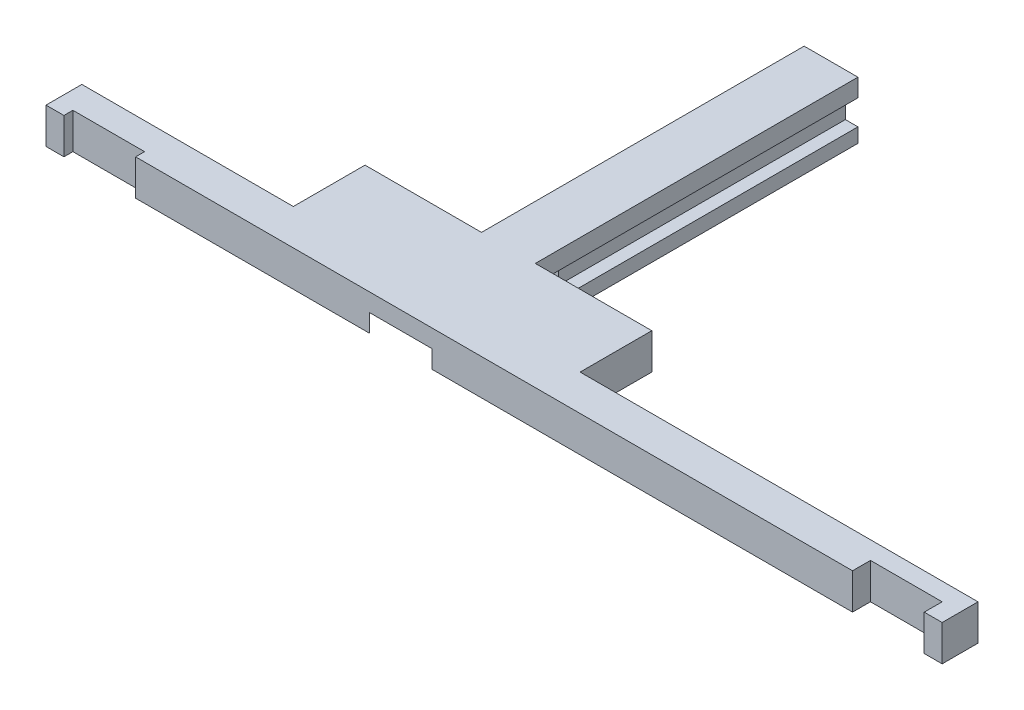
ISO-10303-21;
HEADER;
FILE_DESCRIPTION(('STEP AP214'),'2;1');
FILE_NAME('part.step','',(''),(''),'','','');
FILE_SCHEMA(('AUTOMOTIVE_DESIGN { 1 0 10303 214 1 1 1 1 }'));
ENDSEC;
DATA;
#1=APPLICATION_CONTEXT('core data for automotive mechanical design processes');
#2=APPLICATION_PROTOCOL_DEFINITION('international standard','automotive_design',2000,#1);
#3=PRODUCT_CONTEXT('',#1,'mechanical');
#4=PRODUCT('Part','Part','',(#3));
#5=PRODUCT_RELATED_PRODUCT_CATEGORY('part','',(#4));
#6=PRODUCT_DEFINITION_FORMATION('','',#4);
#7=PRODUCT_DEFINITION_CONTEXT('part definition',#1,'design');
#8=PRODUCT_DEFINITION('design','',#6,#7);
#9=PRODUCT_DEFINITION_SHAPE('','',#8);
#10=(LENGTH_UNIT() NAMED_UNIT(*) SI_UNIT(.MILLI.,.METRE.));
#11=(NAMED_UNIT(*) PLANE_ANGLE_UNIT() SI_UNIT($,.RADIAN.));
#12=(NAMED_UNIT(*) SI_UNIT($,.STERADIAN.) SOLID_ANGLE_UNIT());
#13=UNCERTAINTY_MEASURE_WITH_UNIT(LENGTH_MEASURE(1.E-05),#10,'distance_accuracy_value','');
#14=(GEOMETRIC_REPRESENTATION_CONTEXT(3) GLOBAL_UNCERTAINTY_ASSIGNED_CONTEXT((#13)) GLOBAL_UNIT_ASSIGNED_CONTEXT((#10,
#11,#12)) REPRESENTATION_CONTEXT('',''));
#15=CARTESIAN_POINT('',(0.,0.,0.));
#16=DIRECTION('',(0.,0.,1.));
#17=DIRECTION('',(1.,0.,0.));
#18=AXIS2_PLACEMENT_3D('',#15,#16,#17);
#19=CARTESIAN_POINT('',(-99.,10.,-30.));
#20=DIRECTION('',(0.,0.,1.));
#21=DIRECTION('',(1.,0.,0.));
#22=AXIS2_PLACEMENT_3D('',#19,#20,#21);
#23=PLANE('',#22);
#24=DIRECTION('',(0.,1.,0.));
#25=VECTOR('',#24,1.);
#26=CARTESIAN_POINT('',(-7.49999999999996,10.,-30.));
#27=LINE('',#26,#25);
#28=CARTESIAN_POINT('',(-7.49999999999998,5.,-30.));
#29=VERTEX_POINT('',#28);
#30=CARTESIAN_POINT('',(-7.49999999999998,10.,-30.));
#31=VERTEX_POINT('',#30);
#32=EDGE_CURVE('E327',#29,#31,#27,.T.);
#33=ORIENTED_EDGE('',*,*,#32,.F.);
#34=DIRECTION('',(-1.,0.,0.));
#35=VECTOR('',#34,1.);
#36=CARTESIAN_POINT('',(-99.,5.,-30.));
#37=LINE('',#36,#35);
#38=CARTESIAN_POINT('',(-16.,5.,-30.));
#39=VERTEX_POINT('',#38);
#40=EDGE_CURVE('E403',#29,#39,#37,.T.);
#41=ORIENTED_EDGE('',*,*,#40,.T.);
#42=DIRECTION('',(0.,-1.,0.));
#43=VECTOR('',#42,1.);
#44=CARTESIAN_POINT('',(-16.,5.,-30.));
#45=LINE('',#44,#43);
#46=CARTESIAN_POINT('',(-16.,0.,-30.));
#47=VERTEX_POINT('',#46);
#48=EDGE_CURVE('E400',#47,#39,#45,.F.);
#49=ORIENTED_EDGE('',*,*,#48,.F.);
#50=DIRECTION('',(-1.,0.,0.));
#51=VECTOR('',#50,1.);
#52=CARTESIAN_POINT('',(-99.,0.,-30.));
#53=LINE('',#52,#51);
#54=CARTESIAN_POINT('',(-40.,0.,-30.));
#55=VERTEX_POINT('',#54);
#56=EDGE_CURVE('E442',#47,#55,#53,.T.);
#57=ORIENTED_EDGE('',*,*,#56,.T.);
#58=DIRECTION('',(0.,1.,0.));
#59=VECTOR('',#58,1.);
#60=CARTESIAN_POINT('',(-40.,0.,-30.));
#61=LINE('',#60,#59);
#62=CARTESIAN_POINT('',(-40.,10.,-30.));
#63=VERTEX_POINT('',#62);
#64=EDGE_CURVE('E382',#55,#63,#61,.T.);
#65=ORIENTED_EDGE('',*,*,#64,.T.);
#66=DIRECTION('',(-1.,0.,0.));
#67=VECTOR('',#66,1.);
#68=CARTESIAN_POINT('',(-99.,10.,-30.));
#69=LINE('',#68,#67);
#70=EDGE_CURVE('E414',#31,#63,#69,.T.);
#71=ORIENTED_EDGE('',*,*,#70,.F.);
#72=EDGE_LOOP('',(#33,#41,#49,#57,#65,#71));
#73=FACE_BOUND('',#72,.T.);
#74=ADVANCED_FACE('F37',(#73),#23,.F.);
#75=DIRECTION('',(0.,-1.,0.));
#76=VECTOR('',#75,1.);
#77=CARTESIAN_POINT('',(7.5,10.,-30.));
#78=LINE('',#77,#76);
#79=CARTESIAN_POINT('',(7.50000000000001,10.,-30.));
#80=VERTEX_POINT('',#79);
#81=CARTESIAN_POINT('',(7.5,5.,-30.));
#82=VERTEX_POINT('',#81);
#83=EDGE_CURVE('E254',#80,#82,#78,.T.);
#84=ORIENTED_EDGE('',*,*,#83,.F.);
#85=CARTESIAN_POINT('',(40.,10.,-30.));
#86=VERTEX_POINT('',#85);
#87=EDGE_CURVE('E415',#86,#80,#69,.T.);
#88=ORIENTED_EDGE('',*,*,#87,.F.);
#89=DIRECTION('',(0.,1.,0.));
#90=VECTOR('',#89,1.);
#91=CARTESIAN_POINT('',(40.,0.,-30.));
#92=LINE('',#91,#90);
#93=CARTESIAN_POINT('',(40.,0.,-30.));
#94=VERTEX_POINT('',#93);
#95=EDGE_CURVE('E363',#94,#86,#92,.T.);
#96=ORIENTED_EDGE('',*,*,#95,.F.);
#97=CARTESIAN_POINT('',(16.,0.,-30.));
#98=VERTEX_POINT('',#97);
#99=EDGE_CURVE('E443',#94,#98,#53,.T.);
#100=ORIENTED_EDGE('',*,*,#99,.T.);
#101=DIRECTION('',(0.,-1.,0.));
#102=VECTOR('',#101,1.);
#103=CARTESIAN_POINT('',(16.,5.,-30.));
#104=LINE('',#103,#102);
#105=CARTESIAN_POINT('',(16.,5.,-30.));
#106=VERTEX_POINT('',#105);
#107=EDGE_CURVE('E397',#106,#98,#104,.T.);
#108=ORIENTED_EDGE('',*,*,#107,.F.);
#109=EDGE_CURVE('E404',#106,#82,#37,.T.);
#110=ORIENTED_EDGE('',*,*,#109,.T.);
#111=EDGE_LOOP('',(#84,#88,#96,#100,#108,#110));
#112=FACE_BOUND('',#111,.T.);
#113=ADVANCED_FACE('F583',(#112),#23,.F.);
#114=CARTESIAN_POINT('',(151.,10.,-30.));
#115=DIRECTION('',(-1.,0.,0.));
#116=DIRECTION('',(0.,0.,1.));
#117=AXIS2_PLACEMENT_3D('',#114,#115,#116);
#118=PLANE('',#117);
#119=DIRECTION('',(0.,1.,0.));
#120=VECTOR('',#119,1.);
#121=CARTESIAN_POINT('',(151.,0.,-9.99999999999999));
#122=LINE('',#121,#120);
#123=CARTESIAN_POINT('',(151.,0.,-10.));
#124=VERTEX_POINT('',#123);
#125=CARTESIAN_POINT('',(151.,10.,-9.99999999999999));
#126=VERTEX_POINT('',#125);
#127=EDGE_CURVE('E366',#124,#126,#122,.T.);
#128=ORIENTED_EDGE('',*,*,#127,.T.);
#129=DIRECTION('',(0.,0.,-1.));
#130=VECTOR('',#129,1.);
#131=CARTESIAN_POINT('',(151.,10.,-30.));
#132=LINE('',#131,#130);
#133=CARTESIAN_POINT('',(151.,10.,0.));
#134=VERTEX_POINT('',#133);
#135=EDGE_CURVE('E410',#134,#126,#132,.T.);
#136=ORIENTED_EDGE('',*,*,#135,.F.);
#137=DIRECTION('',(0.,-1.,0.));
#138=VECTOR('',#137,1.);
#139=CARTESIAN_POINT('',(151.,10.,0.));
#140=LINE('',#139,#138);
#141=CARTESIAN_POINT('',(151.,0.,0.));
#142=VERTEX_POINT('',#141);
#143=EDGE_CURVE('E490',#134,#142,#140,.T.);
#144=ORIENTED_EDGE('',*,*,#143,.T.);
#145=DIRECTION('',(0.,0.,-1.));
#146=VECTOR('',#145,1.);
#147=CARTESIAN_POINT('',(151.,0.,-30.));
#148=LINE('',#147,#146);
#149=EDGE_CURVE('E439',#142,#124,#148,.T.);
#150=ORIENTED_EDGE('',*,*,#149,.T.);
#151=EDGE_LOOP('',(#128,#136,#144,#150));
#152=FACE_BOUND('',#151,.T.);
#153=ADVANCED_FACE('F571',(#152),#118,.F.);
#154=CARTESIAN_POINT('',(0.,10.,0.));
#155=DIRECTION('',(0.,-1.,0.));
#156=DIRECTION('',(0.,0.,-1.));
#157=AXIS2_PLACEMENT_3D('',#154,#155,#156);
#158=PLANE('',#157);
#159=DIRECTION('',(0.,0.,-1.));
#160=VECTOR('',#159,1.);
#161=CARTESIAN_POINT('',(40.,10.,0.));
#162=LINE('',#161,#160);
#163=CARTESIAN_POINT('',(40.,10.,-9.99999999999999));
#164=VERTEX_POINT('',#163);
#165=EDGE_CURVE('E357',#164,#86,#162,.T.);
#166=ORIENTED_EDGE('',*,*,#165,.T.);
#167=ORIENTED_EDGE('',*,*,#87,.T.);
#168=DIRECTION('',(0.,0.,1.));
#169=VECTOR('',#168,1.);
#170=CARTESIAN_POINT('',(7.5,10.,-40.));
#171=LINE('',#170,#169);
#172=CARTESIAN_POINT('',(7.5,10.,-120.));
#173=VERTEX_POINT('',#172);
#174=EDGE_CURVE('E255',#173,#80,#171,.T.);
#175=ORIENTED_EDGE('',*,*,#174,.F.);
#176=DIRECTION('',(1.,0.,0.));
#177=VECTOR('',#176,1.);
#178=CARTESIAN_POINT('',(7.5,10.,-120.));
#179=LINE('',#178,#177);
#180=CARTESIAN_POINT('',(-7.49999999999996,10.,-120.));
#181=VERTEX_POINT('',#180);
#182=EDGE_CURVE('E270',#181,#173,#179,.T.);
#183=ORIENTED_EDGE('',*,*,#182,.F.);
#184=DIRECTION('',(0.,0.,1.));
#185=VECTOR('',#184,1.);
#186=CARTESIAN_POINT('',(-7.49999999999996,10.,-40.));
#187=LINE('',#186,#185);
#188=EDGE_CURVE('E335',#181,#31,#187,.T.);
#189=ORIENTED_EDGE('',*,*,#188,.T.);
#190=ORIENTED_EDGE('',*,*,#70,.T.);
#191=DIRECTION('',(0.,0.,-1.));
#192=VECTOR('',#191,1.);
#193=CARTESIAN_POINT('',(-40.,10.,0.));
#194=LINE('',#193,#192);
#195=CARTESIAN_POINT('',(-40.,10.,-10.));
#196=VERTEX_POINT('',#195);
#197=EDGE_CURVE('E374',#196,#63,#194,.T.);
#198=ORIENTED_EDGE('',*,*,#197,.F.);
#199=DIRECTION('',(1.,0.,0.));
#200=VECTOR('',#199,1.);
#201=CARTESIAN_POINT('',(0.,10.,-10.));
#202=LINE('',#201,#200);
#203=CARTESIAN_POINT('',(-99.,10.,-10.));
#204=VERTEX_POINT('',#203);
#205=EDGE_CURVE('E348',#204,#196,#202,.T.);
#206=ORIENTED_EDGE('',*,*,#205,.F.);
#207=DIRECTION('',(0.,0.,1.));
#208=VECTOR('',#207,1.);
#209=CARTESIAN_POINT('',(-99.,10.,-30.));
#210=LINE('',#209,#208);
#211=CARTESIAN_POINT('',(-99.,10.,0.));
#212=VERTEX_POINT('',#211);
#213=EDGE_CURVE('E418',#204,#212,#210,.T.);
#214=ORIENTED_EDGE('',*,*,#213,.T.);
#215=DIRECTION('',(1.,0.,0.));
#216=VECTOR('',#215,1.);
#217=CARTESIAN_POINT('',(-99.,10.,0.));
#218=LINE('',#217,#216);
#219=CARTESIAN_POINT('',(-94.,10.,0.));
#220=VERTEX_POINT('',#219);
#221=EDGE_CURVE('E420',#212,#220,#218,.T.);
#222=ORIENTED_EDGE('',*,*,#221,.T.);
#223=DIRECTION('',(0.,0.,-1.));
#224=VECTOR('',#223,1.);
#225=CARTESIAN_POINT('',(-94.,10.,-2.49999999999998));
#226=LINE('',#225,#224);
#227=CARTESIAN_POINT('',(-94.,10.,-2.49999999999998));
#228=VERTEX_POINT('',#227);
#229=EDGE_CURVE('E422',#220,#228,#226,.T.);
#230=ORIENTED_EDGE('',*,*,#229,.T.);
#231=DIRECTION('',(1.,0.,0.));
#232=VECTOR('',#231,1.);
#233=CARTESIAN_POINT('',(-74.,10.,-2.49999999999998));
#234=LINE('',#233,#232);
#235=CARTESIAN_POINT('',(-74.,10.,-2.49999999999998));
#236=VERTEX_POINT('',#235);
#237=EDGE_CURVE('E424',#228,#236,#234,.T.);
#238=ORIENTED_EDGE('',*,*,#237,.T.);
#239=DIRECTION('',(0.,0.,1.));
#240=VECTOR('',#239,1.);
#241=CARTESIAN_POINT('',(-74.,10.,-2.49999999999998));
#242=LINE('',#241,#240);
#243=CARTESIAN_POINT('',(-74.,10.,0.));
#244=VERTEX_POINT('',#243);
#245=EDGE_CURVE('E426',#236,#244,#242,.T.);
#246=ORIENTED_EDGE('',*,*,#245,.T.);
#247=DIRECTION('',(1.,0.,0.));
#248=VECTOR('',#247,1.);
#249=CARTESIAN_POINT('',(-74.,10.,0.));
#250=LINE('',#249,#248);
#251=CARTESIAN_POINT('',(126.,10.,0.));
#252=VERTEX_POINT('',#251);
#253=EDGE_CURVE('E428',#244,#252,#250,.T.);
#254=ORIENTED_EDGE('',*,*,#253,.T.);
#255=DIRECTION('',(0.,0.,-1.));
#256=VECTOR('',#255,1.);
#257=CARTESIAN_POINT('',(126.,10.,-5.));
#258=LINE('',#257,#256);
#259=CARTESIAN_POINT('',(126.,10.,-5.));
#260=VERTEX_POINT('',#259);
#261=EDGE_CURVE('E430',#252,#260,#258,.T.);
#262=ORIENTED_EDGE('',*,*,#261,.T.);
#263=DIRECTION('',(1.,0.,0.));
#264=VECTOR('',#263,1.);
#265=CARTESIAN_POINT('',(146.,10.,-5.));
#266=LINE('',#265,#264);
#267=CARTESIAN_POINT('',(146.,10.,-5.));
#268=VERTEX_POINT('',#267);
#269=EDGE_CURVE('E432',#260,#268,#266,.T.);
#270=ORIENTED_EDGE('',*,*,#269,.T.);
#271=DIRECTION('',(0.,0.,1.));
#272=VECTOR('',#271,1.);
#273=CARTESIAN_POINT('',(146.,10.,0.));
#274=LINE('',#273,#272);
#275=CARTESIAN_POINT('',(146.,10.,0.));
#276=VERTEX_POINT('',#275);
#277=EDGE_CURVE('E434',#268,#276,#274,.T.);
#278=ORIENTED_EDGE('',*,*,#277,.T.);
#279=DIRECTION('',(1.,0.,0.));
#280=VECTOR('',#279,1.);
#281=CARTESIAN_POINT('',(146.,10.,0.));
#282=LINE('',#281,#280);
#283=EDGE_CURVE('E407',#276,#134,#282,.T.);
#284=ORIENTED_EDGE('',*,*,#283,.T.);
#285=ORIENTED_EDGE('',*,*,#135,.T.);
#286=DIRECTION('',(-1.,0.,0.));
#287=VECTOR('',#286,1.);
#288=CARTESIAN_POINT('',(0.,10.,-9.99999999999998));
#289=LINE('',#288,#287);
#290=EDGE_CURVE('E354',#126,#164,#289,.T.);
#291=ORIENTED_EDGE('',*,*,#290,.T.);
#292=EDGE_LOOP('',(#166,#167,#175,#183,#189,#190,#198,#206,#214,#222,#230,#238,#246,#254,#262,
#270,#278,#284,#285,#291));
#293=FACE_BOUND('',#292,.T.);
#294=ADVANCED_FACE('F537',(#293),#158,.F.);
#295=CARTESIAN_POINT('',(0.,0.,0.));
#296=DIRECTION('',(0.,-1.,0.));
#297=DIRECTION('',(0.,0.,-1.));
#298=AXIS2_PLACEMENT_3D('',#295,#296,#297);
#299=PLANE('',#298);
#300=CARTESIAN_POINT('',(30.,0.,-18.));
#301=DIRECTION('',(0.,-1.,0.));
#302=DIRECTION('',(0.,0.,1.));
#303=AXIS2_PLACEMENT_3D('',#300,#301,#302);
#304=CIRCLE('',#303,2.);
#305=CARTESIAN_POINT('',(30.,0.,-16.));
#306=VERTEX_POINT('',#305);
#307=EDGE_CURVE('E338',#306,#306,#304,.T.);
#308=ORIENTED_EDGE('',*,*,#307,.F.);
#309=EDGE_LOOP('',(#308));
#310=FACE_BOUND('',#309,.T.);
#311=ORIENTED_EDGE('',*,*,#99,.F.);
#312=DIRECTION('',(0.,0.,-1.));
#313=VECTOR('',#312,1.);
#314=CARTESIAN_POINT('',(40.,0.,0.));
#315=LINE('',#314,#313);
#316=CARTESIAN_POINT('',(40.,0.,-9.99999999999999));
#317=VERTEX_POINT('',#316);
#318=EDGE_CURVE('E351',#317,#94,#315,.T.);
#319=ORIENTED_EDGE('',*,*,#318,.F.);
#320=DIRECTION('',(-1.,0.,0.));
#321=VECTOR('',#320,1.);
#322=CARTESIAN_POINT('',(0.,0.,-9.99999999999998));
#323=LINE('',#322,#321);
#324=EDGE_CURVE('E353',#124,#317,#323,.T.);
#325=ORIENTED_EDGE('',*,*,#324,.F.);
#326=ORIENTED_EDGE('',*,*,#149,.F.);
#327=DIRECTION('',(1.,0.,0.));
#328=VECTOR('',#327,1.);
#329=CARTESIAN_POINT('',(146.,0.,0.));
#330=LINE('',#329,#328);
#331=CARTESIAN_POINT('',(146.,0.,0.));
#332=VERTEX_POINT('',#331);
#333=EDGE_CURVE('E406',#332,#142,#330,.T.);
#334=ORIENTED_EDGE('',*,*,#333,.F.);
#335=DIRECTION('',(0.,0.,1.));
#336=VECTOR('',#335,1.);
#337=CARTESIAN_POINT('',(146.,0.,0.));
#338=LINE('',#337,#336);
#339=CARTESIAN_POINT('',(146.,0.,-5.));
#340=VERTEX_POINT('',#339);
#341=EDGE_CURVE('E411',#340,#332,#338,.T.);
#342=ORIENTED_EDGE('',*,*,#341,.F.);
#343=DIRECTION('',(1.,0.,0.));
#344=VECTOR('',#343,1.);
#345=CARTESIAN_POINT('',(146.,0.,-5.));
#346=LINE('',#345,#344);
#347=CARTESIAN_POINT('',(126.,0.,-5.));
#348=VERTEX_POINT('',#347);
#349=EDGE_CURVE('E461',#348,#340,#346,.T.);
#350=ORIENTED_EDGE('',*,*,#349,.F.);
#351=DIRECTION('',(0.,0.,-1.));
#352=VECTOR('',#351,1.);
#353=CARTESIAN_POINT('',(126.,0.,-5.));
#354=LINE('',#353,#352);
#355=CARTESIAN_POINT('',(126.,0.,0.));
#356=VERTEX_POINT('',#355);
#357=EDGE_CURVE('E459',#356,#348,#354,.T.);
#358=ORIENTED_EDGE('',*,*,#357,.F.);
#359=DIRECTION('',(1.,0.,0.));
#360=VECTOR('',#359,1.);
#361=CARTESIAN_POINT('',(-74.,0.,0.));
#362=LINE('',#361,#360);
#363=CARTESIAN_POINT('',(8.71779788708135,0.,0.));
#364=VERTEX_POINT('',#363);
#365=EDGE_CURVE('E455',#364,#356,#362,.T.);
#366=ORIENTED_EDGE('',*,*,#365,.F.);
#367=CARTESIAN_POINT('',(0.,0.,-18.));
#368=DIRECTION('',(0.,1.,0.));
#369=DIRECTION('',(0.,0.,1.));
#370=AXIS2_PLACEMENT_3D('',#367,#368,#369);
#371=CIRCLE('',#370,20.);
#372=EDGE_CURVE('E365',#364,#98,#371,.T.);
#373=ORIENTED_EDGE('',*,*,#372,.T.);
#374=EDGE_LOOP('',(#311,#319,#325,#326,#334,#342,#350,#358,#366,#373));
#375=FACE_BOUND('',#374,.T.);
#376=ADVANCED_FACE('F551',(#310,#375),#299,.T.);
#377=CARTESIAN_POINT('',(-74.,10.,0.));
#378=DIRECTION('',(0.,0.,-1.));
#379=DIRECTION('',(-1.,0.,0.));
#380=AXIS2_PLACEMENT_3D('',#377,#378,#379);
#381=PLANE('',#380);
#382=DIRECTION('',(0.,-1.,0.));
#383=VECTOR('',#382,1.);
#384=CARTESIAN_POINT('',(8.71779788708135,5.,0.));
#385=LINE('',#384,#383);
#386=CARTESIAN_POINT('',(8.71779788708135,5.,0.));
#387=VERTEX_POINT('',#386);
#388=EDGE_CURVE('E395',#364,#387,#385,.F.);
#389=ORIENTED_EDGE('',*,*,#388,.F.);
#390=ORIENTED_EDGE('',*,*,#365,.T.);
#391=DIRECTION('',(0.,-1.,0.));
#392=VECTOR('',#391,1.);
#393=CARTESIAN_POINT('',(126.,10.,0.));
#394=LINE('',#393,#392);
#395=EDGE_CURVE('E472',#252,#356,#394,.T.);
#396=ORIENTED_EDGE('',*,*,#395,.F.);
#397=ORIENTED_EDGE('',*,*,#253,.F.);
#398=DIRECTION('',(0.,-1.,0.));
#399=VECTOR('',#398,1.);
#400=CARTESIAN_POINT('',(-74.,10.,0.));
#401=LINE('',#400,#399);
#402=CARTESIAN_POINT('',(-74.,0.,0.));
#403=VERTEX_POINT('',#402);
#404=EDGE_CURVE('E475',#244,#403,#401,.T.);
#405=ORIENTED_EDGE('',*,*,#404,.T.);
#406=CARTESIAN_POINT('',(-8.71779788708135,0.,0.));
#407=VERTEX_POINT('',#406);
#408=EDGE_CURVE('E456',#403,#407,#362,.T.);
#409=ORIENTED_EDGE('',*,*,#408,.T.);
#410=DIRECTION('',(0.,-1.,0.));
#411=VECTOR('',#410,1.);
#412=CARTESIAN_POINT('',(-8.71779788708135,5.,0.));
#413=LINE('',#412,#411);
#414=CARTESIAN_POINT('',(-8.71779788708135,5.,0.));
#415=VERTEX_POINT('',#414);
#416=EDGE_CURVE('E390',#415,#407,#413,.T.);
#417=ORIENTED_EDGE('',*,*,#416,.F.);
#418=DIRECTION('',(1.,0.,0.));
#419=VECTOR('',#418,1.);
#420=CARTESIAN_POINT('',(-74.,5.,0.));
#421=LINE('',#420,#419);
#422=EDGE_CURVE('E11',#415,#387,#421,.T.);
#423=ORIENTED_EDGE('',*,*,#422,.T.);
#424=EDGE_LOOP('',(#389,#390,#396,#397,#405,#409,#417,#423));
#425=FACE_BOUND('',#424,.T.);
#426=ADVANCED_FACE('F504',(#425),#381,.F.);
#427=CARTESIAN_POINT('',(-30.,0.,-18.));
#428=DIRECTION('',(0.,-1.,0.));
#429=DIRECTION('',(0.,0.,-1.));
#430=AXIS2_PLACEMENT_3D('',#427,#428,#429);
#431=CIRCLE('',#430,2.);
#432=CARTESIAN_POINT('',(-30.,0.,-20.));
#433=VERTEX_POINT('',#432);
#434=EDGE_CURVE('E342',#433,#433,#431,.T.);
#435=ORIENTED_EDGE('',*,*,#434,.F.);
#436=EDGE_LOOP('',(#435));
#437=FACE_BOUND('',#436,.T.);
#438=DIRECTION('',(1.,0.,0.));
#439=VECTOR('',#438,1.);
#440=CARTESIAN_POINT('',(0.,0.,-10.));
#441=LINE('',#440,#439);
#442=CARTESIAN_POINT('',(-99.,0.,-10.));
#443=VERTEX_POINT('',#442);
#444=CARTESIAN_POINT('',(-40.,0.,-10.));
#445=VERTEX_POINT('',#444);
#446=EDGE_CURVE('E370',#443,#445,#441,.T.);
#447=ORIENTED_EDGE('',*,*,#446,.T.);
#448=DIRECTION('',(0.,0.,-1.));
#449=VECTOR('',#448,1.);
#450=CARTESIAN_POINT('',(-40.,0.,0.));
#451=LINE('',#450,#449);
#452=EDGE_CURVE('E373',#445,#55,#451,.T.);
#453=ORIENTED_EDGE('',*,*,#452,.T.);
#454=ORIENTED_EDGE('',*,*,#56,.F.);
#455=CARTESIAN_POINT('',(0.,0.,-18.));
#456=DIRECTION('',(0.,-1.,0.));
#457=DIRECTION('',(0.,0.,-1.));
#458=AXIS2_PLACEMENT_3D('',#455,#456,#457);
#459=CIRCLE('',#458,20.);
#460=EDGE_CURVE('E45',#47,#407,#459,.F.);
#461=ORIENTED_EDGE('',*,*,#460,.T.);
#462=ORIENTED_EDGE('',*,*,#408,.F.);
#463=DIRECTION('',(0.,0.,1.));
#464=VECTOR('',#463,1.);
#465=CARTESIAN_POINT('',(-74.,0.,-2.49999999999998));
#466=LINE('',#465,#464);
#467=CARTESIAN_POINT('',(-74.,0.,-2.49999999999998));
#468=VERTEX_POINT('',#467);
#469=EDGE_CURVE('E453',#468,#403,#466,.T.);
#470=ORIENTED_EDGE('',*,*,#469,.F.);
#471=DIRECTION('',(1.,0.,0.));
#472=VECTOR('',#471,1.);
#473=CARTESIAN_POINT('',(-74.,0.,-2.49999999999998));
#474=LINE('',#473,#472);
#475=CARTESIAN_POINT('',(-94.,0.,-2.49999999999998));
#476=VERTEX_POINT('',#475);
#477=EDGE_CURVE('E451',#476,#468,#474,.T.);
#478=ORIENTED_EDGE('',*,*,#477,.F.);
#479=DIRECTION('',(0.,0.,-1.));
#480=VECTOR('',#479,1.);
#481=CARTESIAN_POINT('',(-94.,0.,-2.49999999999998));
#482=LINE('',#481,#480);
#483=CARTESIAN_POINT('',(-94.,0.,0.));
#484=VERTEX_POINT('',#483);
#485=EDGE_CURVE('E449',#484,#476,#482,.T.);
#486=ORIENTED_EDGE('',*,*,#485,.F.);
#487=DIRECTION('',(1.,0.,0.));
#488=VECTOR('',#487,1.);
#489=CARTESIAN_POINT('',(-99.,0.,0.));
#490=LINE('',#489,#488);
#491=CARTESIAN_POINT('',(-99.,0.,0.));
#492=VERTEX_POINT('',#491);
#493=EDGE_CURVE('E447',#492,#484,#490,.T.);
#494=ORIENTED_EDGE('',*,*,#493,.F.);
#495=DIRECTION('',(0.,0.,1.));
#496=VECTOR('',#495,1.);
#497=CARTESIAN_POINT('',(-99.,0.,-30.));
#498=LINE('',#497,#496);
#499=EDGE_CURVE('E445',#443,#492,#498,.T.);
#500=ORIENTED_EDGE('',*,*,#499,.F.);
#501=EDGE_LOOP('',(#447,#453,#454,#461,#462,#470,#478,#486,#494,#500));
#502=FACE_BOUND('',#501,.T.);
#503=ADVANCED_FACE('F496',(#437,#502),#299,.T.);
#504=CARTESIAN_POINT('',(146.,10.,0.));
#505=DIRECTION('',(0.,0.,-1.));
#506=DIRECTION('',(-1.,0.,0.));
#507=AXIS2_PLACEMENT_3D('',#504,#505,#506);
#508=PLANE('',#507);
#509=ORIENTED_EDGE('',*,*,#333,.T.);
#510=ORIENTED_EDGE('',*,*,#143,.F.);
#511=ORIENTED_EDGE('',*,*,#283,.F.);
#512=DIRECTION('',(0.,-1.,0.));
#513=VECTOR('',#512,1.);
#514=CARTESIAN_POINT('',(146.,10.,0.));
#515=LINE('',#514,#513);
#516=EDGE_CURVE('E436',#276,#332,#515,.T.);
#517=ORIENTED_EDGE('',*,*,#516,.T.);
#518=EDGE_LOOP('',(#509,#510,#511,#517));
#519=FACE_BOUND('',#518,.T.);
#520=ADVANCED_FACE('F39',(#519),#508,.F.);
#521=CARTESIAN_POINT('',(-99.,10.,-30.));
#522=DIRECTION('',(1.,0.,0.));
#523=DIRECTION('',(0.,0.,-1.));
#524=AXIS2_PLACEMENT_3D('',#521,#522,#523);
#525=PLANE('',#524);
#526=ORIENTED_EDGE('',*,*,#213,.F.);
#527=DIRECTION('',(0.,1.,0.));
#528=VECTOR('',#527,1.);
#529=CARTESIAN_POINT('',(-99.,0.,-10.));
#530=LINE('',#529,#528);
#531=EDGE_CURVE('E360',#443,#204,#530,.T.);
#532=ORIENTED_EDGE('',*,*,#531,.F.);
#533=ORIENTED_EDGE('',*,*,#499,.T.);
#534=DIRECTION('',(0.,-1.,0.));
#535=VECTOR('',#534,1.);
#536=CARTESIAN_POINT('',(-99.,10.,0.));
#537=LINE('',#536,#535);
#538=EDGE_CURVE('E487',#212,#492,#537,.T.);
#539=ORIENTED_EDGE('',*,*,#538,.F.);
#540=EDGE_LOOP('',(#526,#532,#533,#539));
#541=FACE_BOUND('',#540,.T.);
#542=ADVANCED_FACE('F531',(#541),#525,.F.);
#543=CARTESIAN_POINT('',(-99.,10.,0.));
#544=DIRECTION('',(0.,0.,-1.));
#545=DIRECTION('',(-1.,0.,0.));
#546=AXIS2_PLACEMENT_3D('',#543,#544,#545);
#547=PLANE('',#546);
#548=ORIENTED_EDGE('',*,*,#493,.T.);
#549=DIRECTION('',(0.,-1.,0.));
#550=VECTOR('',#549,1.);
#551=CARTESIAN_POINT('',(-94.,10.,0.));
#552=LINE('',#551,#550);
#553=EDGE_CURVE('E484',#220,#484,#552,.T.);
#554=ORIENTED_EDGE('',*,*,#553,.F.);
#555=ORIENTED_EDGE('',*,*,#221,.F.);
#556=ORIENTED_EDGE('',*,*,#538,.T.);
#557=EDGE_LOOP('',(#548,#554,#555,#556));
#558=FACE_BOUND('',#557,.T.);
#559=ADVANCED_FACE('F525',(#558),#547,.F.);
#560=CARTESIAN_POINT('',(-94.,10.,-2.49999999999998));
#561=DIRECTION('',(-1.,0.,0.));
#562=DIRECTION('',(0.,0.,1.));
#563=AXIS2_PLACEMENT_3D('',#560,#561,#562);
#564=PLANE('',#563);
#565=ORIENTED_EDGE('',*,*,#485,.T.);
#566=DIRECTION('',(0.,-1.,0.));
#567=VECTOR('',#566,1.);
#568=CARTESIAN_POINT('',(-94.,10.,-2.49999999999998));
#569=LINE('',#568,#567);
#570=EDGE_CURVE('E481',#228,#476,#569,.T.);
#571=ORIENTED_EDGE('',*,*,#570,.F.);
#572=ORIENTED_EDGE('',*,*,#229,.F.);
#573=ORIENTED_EDGE('',*,*,#553,.T.);
#574=EDGE_LOOP('',(#565,#571,#572,#573));
#575=FACE_BOUND('',#574,.T.);
#576=ADVANCED_FACE('F521',(#575),#564,.F.);
#577=CARTESIAN_POINT('',(-74.,10.,-2.49999999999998));
#578=DIRECTION('',(0.,0.,-1.));
#579=DIRECTION('',(-1.,0.,0.));
#580=AXIS2_PLACEMENT_3D('',#577,#578,#579);
#581=PLANE('',#580);
#582=ORIENTED_EDGE('',*,*,#477,.T.);
#583=DIRECTION('',(0.,-1.,0.));
#584=VECTOR('',#583,1.);
#585=CARTESIAN_POINT('',(-74.,10.,-2.49999999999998));
#586=LINE('',#585,#584);
#587=EDGE_CURVE('E478',#236,#468,#586,.T.);
#588=ORIENTED_EDGE('',*,*,#587,.F.);
#589=ORIENTED_EDGE('',*,*,#237,.F.);
#590=ORIENTED_EDGE('',*,*,#570,.T.);
#591=EDGE_LOOP('',(#582,#588,#589,#590));
#592=FACE_BOUND('',#591,.T.);
#593=ADVANCED_FACE('F516',(#592),#581,.F.);
#594=CARTESIAN_POINT('',(-74.,10.,-2.49999999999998));
#595=DIRECTION('',(1.,0.,0.));
#596=DIRECTION('',(0.,0.,-1.));
#597=AXIS2_PLACEMENT_3D('',#594,#595,#596);
#598=PLANE('',#597);
#599=ORIENTED_EDGE('',*,*,#469,.T.);
#600=ORIENTED_EDGE('',*,*,#404,.F.);
#601=ORIENTED_EDGE('',*,*,#245,.F.);
#602=ORIENTED_EDGE('',*,*,#587,.T.);
#603=EDGE_LOOP('',(#599,#600,#601,#602));
#604=FACE_BOUND('',#603,.T.);
#605=ADVANCED_FACE('F510',(#604),#598,.F.);
#606=CARTESIAN_POINT('',(126.,10.,-5.));
#607=DIRECTION('',(-1.,0.,0.));
#608=DIRECTION('',(0.,0.,1.));
#609=AXIS2_PLACEMENT_3D('',#606,#607,#608);
#610=PLANE('',#609);
#611=ORIENTED_EDGE('',*,*,#357,.T.);
#612=DIRECTION('',(0.,-1.,0.));
#613=VECTOR('',#612,1.);
#614=CARTESIAN_POINT('',(126.,10.,-5.));
#615=LINE('',#614,#613);
#616=EDGE_CURVE('E469',#260,#348,#615,.T.);
#617=ORIENTED_EDGE('',*,*,#616,.F.);
#618=ORIENTED_EDGE('',*,*,#261,.F.);
#619=ORIENTED_EDGE('',*,*,#395,.T.);
#620=EDGE_LOOP('',(#611,#617,#618,#619));
#621=FACE_BOUND('',#620,.T.);
#622=ADVANCED_FACE('F556',(#621),#610,.F.);
#623=CARTESIAN_POINT('',(146.,10.,-5.));
#624=DIRECTION('',(0.,0.,-1.));
#625=DIRECTION('',(-1.,0.,0.));
#626=AXIS2_PLACEMENT_3D('',#623,#624,#625);
#627=PLANE('',#626);
#628=ORIENTED_EDGE('',*,*,#349,.T.);
#629=DIRECTION('',(0.,-1.,0.));
#630=VECTOR('',#629,1.);
#631=CARTESIAN_POINT('',(146.,10.,-5.));
#632=LINE('',#631,#630);
#633=EDGE_CURVE('E466',#268,#340,#632,.T.);
#634=ORIENTED_EDGE('',*,*,#633,.F.);
#635=ORIENTED_EDGE('',*,*,#269,.F.);
#636=ORIENTED_EDGE('',*,*,#616,.T.);
#637=EDGE_LOOP('',(#628,#634,#635,#636));
#638=FACE_BOUND('',#637,.T.);
#639=ADVANCED_FACE('F560',(#638),#627,.F.);
#640=CARTESIAN_POINT('',(146.,10.,0.));
#641=DIRECTION('',(1.,0.,0.));
#642=DIRECTION('',(0.,0.,-1.));
#643=AXIS2_PLACEMENT_3D('',#640,#641,#642);
#644=PLANE('',#643);
#645=ORIENTED_EDGE('',*,*,#341,.T.);
#646=ORIENTED_EDGE('',*,*,#516,.F.);
#647=ORIENTED_EDGE('',*,*,#277,.F.);
#648=ORIENTED_EDGE('',*,*,#633,.T.);
#649=EDGE_LOOP('',(#645,#646,#647,#648));
#650=FACE_BOUND('',#649,.T.);
#651=ADVANCED_FACE('F567',(#650),#644,.F.);
#652=CARTESIAN_POINT('',(0.,5.,-18.));
#653=DIRECTION('',(0.,1.,0.));
#654=DIRECTION('',(0.,0.,1.));
#655=AXIS2_PLACEMENT_3D('',#652,#653,#654);
#656=PLANE('',#655);
#657=CARTESIAN_POINT('',(0.,5.,-18.));
#658=DIRECTION('',(0.,1.,0.));
#659=DIRECTION('',(0.,0.,1.));
#660=AXIS2_PLACEMENT_3D('',#657,#658,#659);
#661=CIRCLE('',#660,20.);
#662=EDGE_CURVE('E387',#387,#106,#661,.T.);
#663=ORIENTED_EDGE('',*,*,#662,.F.);
#664=ORIENTED_EDGE('',*,*,#422,.F.);
#665=EDGE_CURVE('E391',#39,#415,#661,.T.);
#666=ORIENTED_EDGE('',*,*,#665,.F.);
#667=ORIENTED_EDGE('',*,*,#40,.F.);
#668=DIRECTION('',(0.,0.,1.));
#669=VECTOR('',#668,1.);
#670=CARTESIAN_POINT('',(-7.49999999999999,5.00000000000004,-40.));
#671=LINE('',#670,#669);
#672=CARTESIAN_POINT('',(-7.49999999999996,5.,-120.));
#673=VERTEX_POINT('',#672);
#674=EDGE_CURVE('E256',#673,#29,#671,.T.);
#675=ORIENTED_EDGE('',*,*,#674,.F.);
#676=DIRECTION('',(-1.,0.,0.));
#677=VECTOR('',#676,1.);
#678=CARTESIAN_POINT('',(-7.49999999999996,5.,-120.));
#679=LINE('',#678,#677);
#680=CARTESIAN_POINT('',(-3.99999999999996,5.,-120.));
#681=VERTEX_POINT('',#680);
#682=EDGE_CURVE('E289',#681,#673,#679,.T.);
#683=ORIENTED_EDGE('',*,*,#682,.F.);
#684=DIRECTION('',(0.,0.,1.));
#685=VECTOR('',#684,1.);
#686=CARTESIAN_POINT('',(-3.99999999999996,5.,-120.));
#687=LINE('',#686,#685);
#688=CARTESIAN_POINT('',(-3.99999999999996,5.00000000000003,-40.));
#689=VERTEX_POINT('',#688);
#690=EDGE_CURVE('E295',#681,#689,#687,.T.);
#691=ORIENTED_EDGE('',*,*,#690,.T.);
#692=DIRECTION('',(-1.,0.,0.));
#693=VECTOR('',#692,1.);
#694=CARTESIAN_POINT('',(7.5,5.,-40.));
#695=LINE('',#694,#693);
#696=CARTESIAN_POINT('',(4.,5.00000000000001,-40.));
#697=VERTEX_POINT('',#696);
#698=EDGE_CURVE('E52',#697,#689,#695,.T.);
#699=ORIENTED_EDGE('',*,*,#698,.F.);
#700=DIRECTION('',(0.,0.,1.));
#701=VECTOR('',#700,1.);
#702=CARTESIAN_POINT('',(4.,5.,-120.));
#703=LINE('',#702,#701);
#704=CARTESIAN_POINT('',(4.,5.,-120.));
#705=VERTEX_POINT('',#704);
#706=EDGE_CURVE('E261',#705,#697,#703,.T.);
#707=ORIENTED_EDGE('',*,*,#706,.F.);
#708=DIRECTION('',(-1.,0.,0.));
#709=VECTOR('',#708,1.);
#710=CARTESIAN_POINT('',(7.5,5.,-120.));
#711=LINE('',#710,#709);
#712=CARTESIAN_POINT('',(7.5,5.,-120.));
#713=VERTEX_POINT('',#712);
#714=EDGE_CURVE('E258',#713,#705,#711,.T.);
#715=ORIENTED_EDGE('',*,*,#714,.F.);
#716=DIRECTION('',(0.,0.,1.));
#717=VECTOR('',#716,1.);
#718=CARTESIAN_POINT('',(7.5,5.,-40.));
#719=LINE('',#718,#717);
#720=EDGE_CURVE('E248',#713,#82,#719,.T.);
#721=ORIENTED_EDGE('',*,*,#720,.T.);
#722=ORIENTED_EDGE('',*,*,#109,.F.);
#723=EDGE_LOOP('',(#663,#664,#666,#667,#675,#683,#691,#699,#707,#715,#721,#722));
#724=FACE_BOUND('',#723,.T.);
#725=ADVANCED_FACE('F260',(#724),#656,.F.);
#726=CARTESIAN_POINT('',(0.,5.,-18.));
#727=DIRECTION('',(0.,-1.,0.));
#728=DIRECTION('',(0.,0.,-1.));
#729=AXIS2_PLACEMENT_3D('',#726,#727,#728);
#730=CYLINDRICAL_SURFACE('',#729,20.);
#731=ORIENTED_EDGE('',*,*,#48,.T.);
#732=ORIENTED_EDGE('',*,*,#665,.T.);
#733=ORIENTED_EDGE('',*,*,#416,.T.);
#734=ORIENTED_EDGE('',*,*,#460,.F.);
#735=EDGE_LOOP('',(#731,#732,#733,#734));
#736=FACE_BOUND('',#735,.T.);
#737=ADVANCED_FACE('F545',(#736),#730,.F.);
#738=ORIENTED_EDGE('',*,*,#107,.T.);
#739=ORIENTED_EDGE('',*,*,#372,.F.);
#740=ORIENTED_EDGE('',*,*,#388,.T.);
#741=ORIENTED_EDGE('',*,*,#662,.T.);
#742=EDGE_LOOP('',(#738,#739,#740,#741));
#743=FACE_BOUND('',#742,.T.);
#744=ADVANCED_FACE('F702',(#743),#730,.F.);
#745=CARTESIAN_POINT('',(40.,0.,0.));
#746=DIRECTION('',(1.,0.,0.));
#747=DIRECTION('',(0.,0.,-1.));
#748=AXIS2_PLACEMENT_3D('',#745,#746,#747);
#749=PLANE('',#748);
#750=ORIENTED_EDGE('',*,*,#165,.F.);
#751=DIRECTION('',(0.,1.,0.));
#752=VECTOR('',#751,1.);
#753=CARTESIAN_POINT('',(40.,0.,-9.99999999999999));
#754=LINE('',#753,#752);
#755=EDGE_CURVE('E356',#317,#164,#754,.T.);
#756=ORIENTED_EDGE('',*,*,#755,.F.);
#757=ORIENTED_EDGE('',*,*,#318,.T.);
#758=ORIENTED_EDGE('',*,*,#95,.T.);
#759=EDGE_LOOP('',(#750,#756,#757,#758));
#760=FACE_BOUND('',#759,.T.);
#761=ADVANCED_FACE('F580',(#760),#749,.T.);
#762=CARTESIAN_POINT('',(0.,0.,-9.99999999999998));
#763=DIRECTION('',(0.,0.,-1.));
#764=DIRECTION('',(-1.,0.,0.));
#765=AXIS2_PLACEMENT_3D('',#762,#763,#764);
#766=PLANE('',#765);
#767=ORIENTED_EDGE('',*,*,#290,.F.);
#768=ORIENTED_EDGE('',*,*,#127,.F.);
#769=ORIENTED_EDGE('',*,*,#324,.T.);
#770=ORIENTED_EDGE('',*,*,#755,.T.);
#771=EDGE_LOOP('',(#767,#768,#769,#770));
#772=FACE_BOUND('',#771,.T.);
#773=ADVANCED_FACE('F575',(#772),#766,.T.);
#774=CARTESIAN_POINT('',(0.,0.,-10.));
#775=DIRECTION('',(0.,0.,1.));
#776=DIRECTION('',(1.,0.,0.));
#777=AXIS2_PLACEMENT_3D('',#774,#775,#776);
#778=PLANE('',#777);
#779=ORIENTED_EDGE('',*,*,#205,.T.);
#780=DIRECTION('',(0.,1.,0.));
#781=VECTOR('',#780,1.);
#782=CARTESIAN_POINT('',(-40.,0.,-10.));
#783=LINE('',#782,#781);
#784=EDGE_CURVE('E377',#445,#196,#783,.T.);
#785=ORIENTED_EDGE('',*,*,#784,.F.);
#786=ORIENTED_EDGE('',*,*,#446,.F.);
#787=ORIENTED_EDGE('',*,*,#531,.T.);
#788=EDGE_LOOP('',(#779,#785,#786,#787));
#789=FACE_BOUND('',#788,.T.);
#790=ADVANCED_FACE('F534',(#789),#778,.F.);
#791=CARTESIAN_POINT('',(-40.,0.,0.));
#792=DIRECTION('',(1.,0.,0.));
#793=DIRECTION('',(0.,0.,-1.));
#794=AXIS2_PLACEMENT_3D('',#791,#792,#793);
#795=PLANE('',#794);
#796=ORIENTED_EDGE('',*,*,#197,.T.);
#797=ORIENTED_EDGE('',*,*,#64,.F.);
#798=ORIENTED_EDGE('',*,*,#452,.F.);
#799=ORIENTED_EDGE('',*,*,#784,.T.);
#800=EDGE_LOOP('',(#796,#797,#798,#799));
#801=FACE_BOUND('',#800,.T.);
#802=ADVANCED_FACE('F539',(#801),#795,.F.);
#803=CARTESIAN_POINT('',(-30.,-10.,-18.));
#804=DIRECTION('',(0.,1.,0.));
#805=DIRECTION('',(0.,0.,1.));
#806=AXIS2_PLACEMENT_3D('',#803,#804,#805);
#807=CYLINDRICAL_SURFACE('',#806,2.);
#808=CARTESIAN_POINT('',(-30.,-10.,-18.));
#809=DIRECTION('',(0.,-1.,0.));
#810=DIRECTION('',(0.,0.,-1.));
#811=AXIS2_PLACEMENT_3D('',#808,#809,#810);
#812=CIRCLE('',#811,2.);
#813=CARTESIAN_POINT('',(-30.,-10.,-20.));
#814=VERTEX_POINT('',#813);
#815=EDGE_CURVE('E345',#814,#814,#812,.T.);
#816=ORIENTED_EDGE('',*,*,#815,.F.);
#817=EDGE_LOOP('',(#816));
#818=FACE_BOUND('',#817,.T.);
#819=ORIENTED_EDGE('',*,*,#434,.T.);
#820=EDGE_LOOP('',(#819));
#821=FACE_BOUND('',#820,.T.);
#822=ADVANCED_FACE('F684',(#818,#821),#807,.T.);
#823=CARTESIAN_POINT('',(-30.,-10.,-18.));
#824=DIRECTION('',(0.,-1.,0.));
#825=DIRECTION('',(0.,0.,-1.));
#826=AXIS2_PLACEMENT_3D('',#823,#824,#825);
#827=PLANE('',#826);
#828=ORIENTED_EDGE('',*,*,#815,.T.);
#829=EDGE_LOOP('',(#828));
#830=FACE_BOUND('',#829,.T.);
#831=ADVANCED_FACE('F686',(#830),#827,.T.);
#832=CARTESIAN_POINT('',(30.,-10.,-18.));
#833=DIRECTION('',(0.,1.,0.));
#834=DIRECTION('',(0.,0.,1.));
#835=AXIS2_PLACEMENT_3D('',#832,#833,#834);
#836=CYLINDRICAL_SURFACE('',#835,2.);
#837=CARTESIAN_POINT('',(30.,-10.,-18.));
#838=DIRECTION('',(0.,-1.,0.));
#839=DIRECTION('',(0.,0.,1.));
#840=AXIS2_PLACEMENT_3D('',#837,#838,#839);
#841=CIRCLE('',#840,2.);
#842=CARTESIAN_POINT('',(30.,-10.,-16.));
#843=VERTEX_POINT('',#842);
#844=EDGE_CURVE('E339',#843,#843,#841,.T.);
#845=ORIENTED_EDGE('',*,*,#844,.F.);
#846=EDGE_LOOP('',(#845));
#847=FACE_BOUND('',#846,.T.);
#848=ORIENTED_EDGE('',*,*,#307,.T.);
#849=EDGE_LOOP('',(#848));
#850=FACE_BOUND('',#849,.T.);
#851=ADVANCED_FACE('F692',(#847,#850),#836,.T.);
#852=CARTESIAN_POINT('',(30.,-10.,-18.));
#853=DIRECTION('',(0.,1.,0.));
#854=DIRECTION('',(0.,0.,1.));
#855=AXIS2_PLACEMENT_3D('',#852,#853,#854);
#856=PLANE('',#855);
#857=ORIENTED_EDGE('',*,*,#844,.T.);
#858=EDGE_LOOP('',(#857));
#859=FACE_BOUND('',#858,.T.);
#860=ADVANCED_FACE('F781',(#859),#856,.F.);
#861=CARTESIAN_POINT('',(-7.49999999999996,10.,-40.));
#862=DIRECTION('',(1.,0.,0.));
#863=DIRECTION('',(0.,1.,0.));
#864=AXIS2_PLACEMENT_3D('',#861,#862,#863);
#865=PLANE('',#864);
#866=ORIENTED_EDGE('',*,*,#32,.T.);
#867=ORIENTED_EDGE('',*,*,#188,.F.);
#868=DIRECTION('',(0.,1.,0.));
#869=VECTOR('',#868,1.);
#870=CARTESIAN_POINT('',(-7.49999999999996,10.,-120.));
#871=LINE('',#870,#869);
#872=EDGE_CURVE('E292',#673,#181,#871,.T.);
#873=ORIENTED_EDGE('',*,*,#872,.F.);
#874=ORIENTED_EDGE('',*,*,#674,.T.);
#875=EDGE_LOOP('',(#866,#867,#873,#874));
#876=FACE_BOUND('',#875,.T.);
#877=ADVANCED_FACE('F587',(#876),#865,.F.);
#878=CARTESIAN_POINT('',(7.5,10.,-40.));
#879=DIRECTION('',(-1.,0.,0.));
#880=DIRECTION('',(0.,0.,1.));
#881=AXIS2_PLACEMENT_3D('',#878,#879,#880);
#882=PLANE('',#881);
#883=ORIENTED_EDGE('',*,*,#83,.T.);
#884=ORIENTED_EDGE('',*,*,#720,.F.);
#885=DIRECTION('',(0.,-1.,0.));
#886=VECTOR('',#885,1.);
#887=CARTESIAN_POINT('',(7.5,10.,-120.));
#888=LINE('',#887,#886);
#889=EDGE_CURVE('E253',#173,#713,#888,.T.);
#890=ORIENTED_EDGE('',*,*,#889,.F.);
#891=ORIENTED_EDGE('',*,*,#174,.T.);
#892=EDGE_LOOP('',(#883,#884,#890,#891));
#893=FACE_BOUND('',#892,.T.);
#894=ADVANCED_FACE('F250',(#893),#882,.F.);
#895=CARTESIAN_POINT('',(0.,0.,-40.));
#896=DIRECTION('',(0.,0.,-1.));
#897=DIRECTION('',(-1.,0.,0.));
#898=AXIS2_PLACEMENT_3D('',#895,#896,#897);
#899=PLANE('',#898);
#900=DIRECTION('',(0.,-1.,0.));
#901=VECTOR('',#900,1.);
#902=CARTESIAN_POINT('',(4.,5.,-40.));
#903=LINE('',#902,#901);
#904=CARTESIAN_POINT('',(4.,-2.,-40.));
#905=VERTEX_POINT('',#904);
#906=EDGE_CURVE('E296',#697,#905,#903,.T.);
#907=ORIENTED_EDGE('',*,*,#906,.F.);
#908=ORIENTED_EDGE('',*,*,#698,.T.);
#909=DIRECTION('',(0.,1.,0.));
#910=VECTOR('',#909,1.);
#911=CARTESIAN_POINT('',(-3.99999999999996,5.,-40.));
#912=LINE('',#911,#910);
#913=CARTESIAN_POINT('',(-3.99999999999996,-2.,-40.));
#914=VERTEX_POINT('',#913);
#915=EDGE_CURVE('E271',#914,#689,#912,.T.);
#916=ORIENTED_EDGE('',*,*,#915,.F.);
#917=DIRECTION('',(1.,0.,0.));
#918=VECTOR('',#917,1.);
#919=CARTESIAN_POINT('',(-3.99999999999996,-2.,-40.));
#920=LINE('',#919,#918);
#921=CARTESIAN_POINT('',(-7.49999999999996,-1.99999999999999,-40.));
#922=VERTEX_POINT('',#921);
#923=EDGE_CURVE('E273',#922,#914,#920,.T.);
#924=ORIENTED_EDGE('',*,*,#923,.F.);
#925=DIRECTION('',(0.,1.,0.));
#926=VECTOR('',#925,1.);
#927=CARTESIAN_POINT('',(-7.49999999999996,-1.99999999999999,-40.));
#928=LINE('',#927,#926);
#929=CARTESIAN_POINT('',(-7.49999999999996,-6.,-40.));
#930=VERTEX_POINT('',#929);
#931=EDGE_CURVE('E304',#930,#922,#928,.T.);
#932=ORIENTED_EDGE('',*,*,#931,.F.);
#933=DIRECTION('',(-1.,0.,0.));
#934=VECTOR('',#933,1.);
#935=CARTESIAN_POINT('',(7.5,-6.,-40.));
#936=LINE('',#935,#934);
#937=CARTESIAN_POINT('',(7.5,-6.,-40.));
#938=VERTEX_POINT('',#937);
#939=EDGE_CURVE('E302',#938,#930,#936,.T.);
#940=ORIENTED_EDGE('',*,*,#939,.F.);
#941=DIRECTION('',(0.,-1.,0.));
#942=VECTOR('',#941,1.);
#943=CARTESIAN_POINT('',(7.5,-2.,-40.));
#944=LINE('',#943,#942);
#945=CARTESIAN_POINT('',(7.5,-2.,-40.));
#946=VERTEX_POINT('',#945);
#947=EDGE_CURVE('E300',#946,#938,#944,.T.);
#948=ORIENTED_EDGE('',*,*,#947,.F.);
#949=DIRECTION('',(1.,0.,0.));
#950=VECTOR('',#949,1.);
#951=CARTESIAN_POINT('',(4.,-2.,-40.));
#952=LINE('',#951,#950);
#953=EDGE_CURVE('E298',#905,#946,#952,.T.);
#954=ORIENTED_EDGE('',*,*,#953,.F.);
#955=EDGE_LOOP('',(#907,#908,#916,#924,#932,#940,#948,#954));
#956=FACE_BOUND('',#955,.T.);
#957=ADVANCED_FACE('F596',(#956),#899,.F.);
#958=CARTESIAN_POINT('',(4.,5.,-120.));
#959=DIRECTION('',(-1.,0.,0.));
#960=DIRECTION('',(0.,-1.,0.));
#961=AXIS2_PLACEMENT_3D('',#958,#959,#960);
#962=PLANE('',#961);
#963=ORIENTED_EDGE('',*,*,#906,.T.);
#964=DIRECTION('',(0.,0.,1.));
#965=VECTOR('',#964,1.);
#966=CARTESIAN_POINT('',(4.,-2.,-120.));
#967=LINE('',#966,#965);
#968=CARTESIAN_POINT('',(4.,-2.,-120.));
#969=VERTEX_POINT('',#968);
#970=EDGE_CURVE('E323',#969,#905,#967,.T.);
#971=ORIENTED_EDGE('',*,*,#970,.F.);
#972=DIRECTION('',(0.,-1.,0.));
#973=VECTOR('',#972,1.);
#974=CARTESIAN_POINT('',(4.,5.,-120.));
#975=LINE('',#974,#973);
#976=EDGE_CURVE('E264',#705,#969,#975,.T.);
#977=ORIENTED_EDGE('',*,*,#976,.F.);
#978=ORIENTED_EDGE('',*,*,#706,.T.);
#979=EDGE_LOOP('',(#963,#971,#977,#978));
#980=FACE_BOUND('',#979,.T.);
#981=ADVANCED_FACE('F621',(#980),#962,.F.);
#982=CARTESIAN_POINT('',(4.,-2.,-120.));
#983=DIRECTION('',(0.,-1.,0.));
#984=DIRECTION('',(0.,0.,-1.));
#985=AXIS2_PLACEMENT_3D('',#982,#983,#984);
#986=PLANE('',#985);
#987=ORIENTED_EDGE('',*,*,#953,.T.);
#988=DIRECTION('',(0.,0.,1.));
#989=VECTOR('',#988,1.);
#990=CARTESIAN_POINT('',(7.5,-2.,-120.));
#991=LINE('',#990,#989);
#992=CARTESIAN_POINT('',(7.5,-2.,-120.));
#993=VERTEX_POINT('',#992);
#994=EDGE_CURVE('E320',#993,#946,#991,.T.);
#995=ORIENTED_EDGE('',*,*,#994,.F.);
#996=DIRECTION('',(1.,0.,0.));
#997=VECTOR('',#996,1.);
#998=CARTESIAN_POINT('',(4.,-2.,-120.));
#999=LINE('',#998,#997);
#1000=EDGE_CURVE('E277',#969,#993,#999,.T.);
#1001=ORIENTED_EDGE('',*,*,#1000,.F.);
#1002=ORIENTED_EDGE('',*,*,#970,.T.);
#1003=EDGE_LOOP('',(#987,#995,#1001,#1002));
#1004=FACE_BOUND('',#1003,.T.);
#1005=ADVANCED_FACE('F618',(#1004),#986,.F.);
#1006=CARTESIAN_POINT('',(7.5,-2.,-120.));
#1007=DIRECTION('',(-1.,0.,0.));
#1008=DIRECTION('',(0.,0.,1.));
#1009=AXIS2_PLACEMENT_3D('',#1006,#1007,#1008);
#1010=PLANE('',#1009);
#1011=ORIENTED_EDGE('',*,*,#947,.T.);
#1012=DIRECTION('',(0.,0.,1.));
#1013=VECTOR('',#1012,1.);
#1014=CARTESIAN_POINT('',(7.5,-6.,-120.));
#1015=LINE('',#1014,#1013);
#1016=CARTESIAN_POINT('',(7.5,-6.,-120.));
#1017=VERTEX_POINT('',#1016);
#1018=EDGE_CURVE('E317',#1017,#938,#1015,.T.);
#1019=ORIENTED_EDGE('',*,*,#1018,.F.);
#1020=DIRECTION('',(0.,-1.,0.));
#1021=VECTOR('',#1020,1.);
#1022=CARTESIAN_POINT('',(7.5,-2.,-120.));
#1023=LINE('',#1022,#1021);
#1024=EDGE_CURVE('E279',#993,#1017,#1023,.T.);
#1025=ORIENTED_EDGE('',*,*,#1024,.F.);
#1026=ORIENTED_EDGE('',*,*,#994,.T.);
#1027=EDGE_LOOP('',(#1011,#1019,#1025,#1026));
#1028=FACE_BOUND('',#1027,.T.);
#1029=ADVANCED_FACE('F613',(#1028),#1010,.F.);
#1030=CARTESIAN_POINT('',(7.5,-6.,-120.));
#1031=DIRECTION('',(0.,1.,0.));
#1032=DIRECTION('',(0.,0.,1.));
#1033=AXIS2_PLACEMENT_3D('',#1030,#1031,#1032);
#1034=PLANE('',#1033);
#1035=ORIENTED_EDGE('',*,*,#939,.T.);
#1036=DIRECTION('',(0.,0.,1.));
#1037=VECTOR('',#1036,1.);
#1038=CARTESIAN_POINT('',(-7.49999999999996,-6.,-120.));
#1039=LINE('',#1038,#1037);
#1040=CARTESIAN_POINT('',(-7.49999999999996,-6.,-120.));
#1041=VERTEX_POINT('',#1040);
#1042=EDGE_CURVE('E314',#1041,#930,#1039,.T.);
#1043=ORIENTED_EDGE('',*,*,#1042,.F.);
#1044=DIRECTION('',(-1.,0.,0.));
#1045=VECTOR('',#1044,1.);
#1046=CARTESIAN_POINT('',(7.5,-6.,-120.));
#1047=LINE('',#1046,#1045);
#1048=EDGE_CURVE('E281',#1017,#1041,#1047,.T.);
#1049=ORIENTED_EDGE('',*,*,#1048,.F.);
#1050=ORIENTED_EDGE('',*,*,#1018,.T.);
#1051=EDGE_LOOP('',(#1035,#1043,#1049,#1050));
#1052=FACE_BOUND('',#1051,.T.);
#1053=ADVANCED_FACE('F608',(#1052),#1034,.F.);
#1054=CARTESIAN_POINT('',(-7.49999999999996,-1.99999999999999,-120.));
#1055=DIRECTION('',(1.,0.,0.));
#1056=DIRECTION('',(0.,0.,-1.));
#1057=AXIS2_PLACEMENT_3D('',#1054,#1055,#1056);
#1058=PLANE('',#1057);
#1059=ORIENTED_EDGE('',*,*,#931,.T.);
#1060=DIRECTION('',(0.,0.,1.));
#1061=VECTOR('',#1060,1.);
#1062=CARTESIAN_POINT('',(-7.49999999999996,-1.99999999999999,-120.));
#1063=LINE('',#1062,#1061);
#1064=CARTESIAN_POINT('',(-7.49999999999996,-1.99999999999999,-120.));
#1065=VERTEX_POINT('',#1064);
#1066=EDGE_CURVE('E311',#1065,#922,#1063,.T.);
#1067=ORIENTED_EDGE('',*,*,#1066,.F.);
#1068=DIRECTION('',(0.,1.,0.));
#1069=VECTOR('',#1068,1.);
#1070=CARTESIAN_POINT('',(-7.49999999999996,-1.99999999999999,-120.));
#1071=LINE('',#1070,#1069);
#1072=EDGE_CURVE('E283',#1041,#1065,#1071,.T.);
#1073=ORIENTED_EDGE('',*,*,#1072,.F.);
#1074=ORIENTED_EDGE('',*,*,#1042,.T.);
#1075=EDGE_LOOP('',(#1059,#1067,#1073,#1074));
#1076=FACE_BOUND('',#1075,.T.);
#1077=ADVANCED_FACE('F604',(#1076),#1058,.F.);
#1078=CARTESIAN_POINT('',(-3.99999999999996,-2.,-120.));
#1079=DIRECTION('',(0.,-1.,0.));
#1080=DIRECTION('',(1.,0.,0.));
#1081=AXIS2_PLACEMENT_3D('',#1078,#1079,#1080);
#1082=PLANE('',#1081);
#1083=ORIENTED_EDGE('',*,*,#923,.T.);
#1084=DIRECTION('',(0.,0.,1.));
#1085=VECTOR('',#1084,1.);
#1086=CARTESIAN_POINT('',(-3.99999999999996,-2.,-120.));
#1087=LINE('',#1086,#1085);
#1088=CARTESIAN_POINT('',(-3.99999999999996,-2.,-120.));
#1089=VERTEX_POINT('',#1088);
#1090=EDGE_CURVE('E308',#1089,#914,#1087,.T.);
#1091=ORIENTED_EDGE('',*,*,#1090,.F.);
#1092=DIRECTION('',(1.,0.,0.));
#1093=VECTOR('',#1092,1.);
#1094=CARTESIAN_POINT('',(-3.99999999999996,-2.,-120.));
#1095=LINE('',#1094,#1093);
#1096=EDGE_CURVE('E285',#1065,#1089,#1095,.T.);
#1097=ORIENTED_EDGE('',*,*,#1096,.F.);
#1098=ORIENTED_EDGE('',*,*,#1066,.T.);
#1099=EDGE_LOOP('',(#1083,#1091,#1097,#1098));
#1100=FACE_BOUND('',#1099,.T.);
#1101=ADVANCED_FACE('F600',(#1100),#1082,.F.);
#1102=CARTESIAN_POINT('',(-3.99999999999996,5.,-120.));
#1103=DIRECTION('',(1.,0.,0.));
#1104=DIRECTION('',(0.,1.,0.));
#1105=AXIS2_PLACEMENT_3D('',#1102,#1103,#1104);
#1106=PLANE('',#1105);
#1107=ORIENTED_EDGE('',*,*,#915,.T.);
#1108=ORIENTED_EDGE('',*,*,#690,.F.);
#1109=DIRECTION('',(0.,1.,0.));
#1110=VECTOR('',#1109,1.);
#1111=CARTESIAN_POINT('',(-3.99999999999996,5.,-120.));
#1112=LINE('',#1111,#1110);
#1113=EDGE_CURVE('E287',#1089,#681,#1112,.T.);
#1114=ORIENTED_EDGE('',*,*,#1113,.F.);
#1115=ORIENTED_EDGE('',*,*,#1090,.T.);
#1116=EDGE_LOOP('',(#1107,#1108,#1114,#1115));
#1117=FACE_BOUND('',#1116,.T.);
#1118=ADVANCED_FACE('F594',(#1117),#1106,.F.);
#1119=CARTESIAN_POINT('',(0.,0.,-120.));
#1120=DIRECTION('',(0.,0.,-1.));
#1121=DIRECTION('',(-1.,0.,0.));
#1122=AXIS2_PLACEMENT_3D('',#1119,#1120,#1121);
#1123=PLANE('',#1122);
#1124=ORIENTED_EDGE('',*,*,#889,.T.);
#1125=ORIENTED_EDGE('',*,*,#714,.T.);
#1126=ORIENTED_EDGE('',*,*,#976,.T.);
#1127=ORIENTED_EDGE('',*,*,#1000,.T.);
#1128=ORIENTED_EDGE('',*,*,#1024,.T.);
#1129=ORIENTED_EDGE('',*,*,#1048,.T.);
#1130=ORIENTED_EDGE('',*,*,#1072,.T.);
#1131=ORIENTED_EDGE('',*,*,#1096,.T.);
#1132=ORIENTED_EDGE('',*,*,#1113,.T.);
#1133=ORIENTED_EDGE('',*,*,#682,.T.);
#1134=ORIENTED_EDGE('',*,*,#872,.T.);
#1135=ORIENTED_EDGE('',*,*,#182,.T.);
#1136=EDGE_LOOP('',(#1124,#1125,#1126,#1127,#1128,#1129,#1130,#1131,#1132,#1133,#1134,#1135));
#1137=FACE_BOUND('',#1136,.T.);
#1138=ADVANCED_FACE('F267',(#1137),#1123,.T.);
#1139=CLOSED_SHELL('',(#74,#113,#153,#294,#376,#426,#503,#520,#542,#559,#576,#593,#605,#622,
#639,#651,#725,#737,#744,#761,#773,#790,#802,#822,#831,#851,#860,#877,#894,#957,#981,#1005,
#1029,#1053,#1077,#1101,#1118,#1138));
#1140=MANIFOLD_SOLID_BREP('B2',#1139);
#1141=ADVANCED_BREP_SHAPE_REPRESENTATION('',(#18,#1140),#14);
#1142=SHAPE_DEFINITION_REPRESENTATION(#9,#1141);
ENDSEC;
END-ISO-10303-21;
